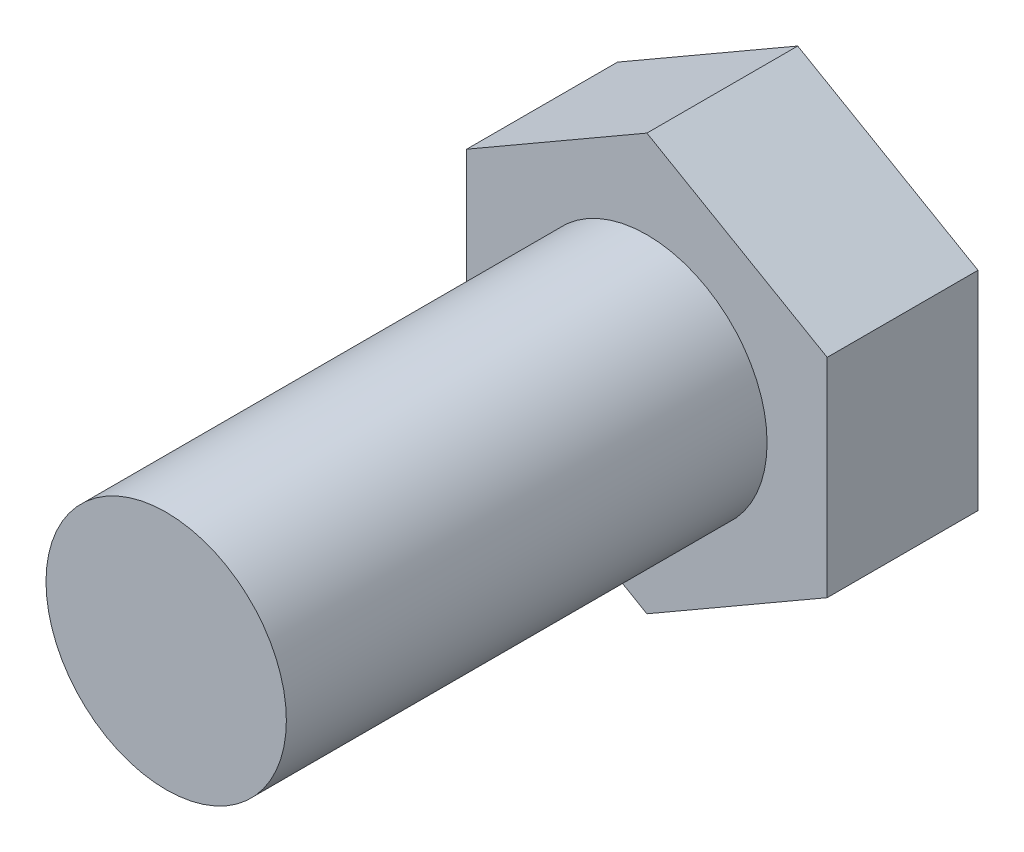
ISO-10303-21;
HEADER;
FILE_DESCRIPTION(('STEP AP214'),'2;1');
FILE_NAME('part.step','',(''),(''),'','','');
FILE_SCHEMA(('AUTOMOTIVE_DESIGN { 1 0 10303 214 1 1 1 1 }'));
ENDSEC;
DATA;
#1=APPLICATION_CONTEXT('core data for automotive mechanical design processes');
#2=APPLICATION_PROTOCOL_DEFINITION('international standard','automotive_design',2000,#1);
#3=PRODUCT_CONTEXT('',#1,'mechanical');
#4=PRODUCT('Part','Part','',(#3));
#5=PRODUCT_RELATED_PRODUCT_CATEGORY('part','',(#4));
#6=PRODUCT_DEFINITION_FORMATION('','',#4);
#7=PRODUCT_DEFINITION_CONTEXT('part definition',#1,'design');
#8=PRODUCT_DEFINITION('design','',#6,#7);
#9=PRODUCT_DEFINITION_SHAPE('','',#8);
#10=(LENGTH_UNIT() NAMED_UNIT(*) SI_UNIT(.MILLI.,.METRE.));
#11=(NAMED_UNIT(*) PLANE_ANGLE_UNIT() SI_UNIT($,.RADIAN.));
#12=(NAMED_UNIT(*) SI_UNIT($,.STERADIAN.) SOLID_ANGLE_UNIT());
#13=UNCERTAINTY_MEASURE_WITH_UNIT(LENGTH_MEASURE(1.E-05),#10,'distance_accuracy_value','');
#14=(GEOMETRIC_REPRESENTATION_CONTEXT(3) GLOBAL_UNCERTAINTY_ASSIGNED_CONTEXT((#13)) GLOBAL_UNIT_ASSIGNED_CONTEXT((#10,
#11,#12)) REPRESENTATION_CONTEXT('',''));
#15=CARTESIAN_POINT('',(0.,0.,0.));
#16=DIRECTION('',(0.,0.,1.));
#17=DIRECTION('',(1.,0.,0.));
#18=AXIS2_PLACEMENT_3D('',#15,#16,#17);
#19=CARTESIAN_POINT('',(0.,0.,53.7));
#20=DIRECTION('',(0.,0.,-1.));
#21=DIRECTION('',(-1.,0.,0.));
#22=AXIS2_PLACEMENT_3D('',#19,#20,#21);
#23=PLANE('',#22);
#24=CARTESIAN_POINT('',(0.,0.,53.7));
#25=DIRECTION('',(0.,0.,-1.));
#26=DIRECTION('',(-1.,0.,0.));
#27=AXIS2_PLACEMENT_3D('',#24,#25,#26);
#28=CIRCLE('',#27,10.);
#29=CARTESIAN_POINT('',(-10.,0.,53.7));
#30=VERTEX_POINT('',#29);
#31=EDGE_CURVE('E22',#30,#30,#28,.T.);
#32=ORIENTED_EDGE('',*,*,#31,.F.);
#33=EDGE_LOOP('',(#32));
#34=FACE_BOUND('',#33,.T.);
#35=ADVANCED_FACE('F15',(#34),#23,.F.);
#36=CARTESIAN_POINT('',(0.,0.,-16.3));
#37=DIRECTION('',(0.,0.,-1.));
#38=DIRECTION('',(-1.,0.,0.));
#39=AXIS2_PLACEMENT_3D('',#36,#37,#38);
#40=CYLINDRICAL_SURFACE('',#39,10.);
#41=CARTESIAN_POINT('',(0.,0.,13.7));
#42=DIRECTION('',(0.,0.,-1.));
#43=DIRECTION('',(-1.,0.,0.));
#44=AXIS2_PLACEMENT_3D('',#41,#42,#43);
#45=CIRCLE('',#44,10.);
#46=CARTESIAN_POINT('',(-10.,0.,13.7));
#47=VERTEX_POINT('',#46);
#48=EDGE_CURVE('E110',#47,#47,#45,.T.);
#49=ORIENTED_EDGE('',*,*,#48,.F.);
#50=EDGE_LOOP('',(#49));
#51=FACE_BOUND('',#50,.T.);
#52=ORIENTED_EDGE('',*,*,#31,.T.);
#53=EDGE_LOOP('',(#52));
#54=FACE_BOUND('',#53,.T.);
#55=ADVANCED_FACE('F154',(#51,#54),#40,.T.);
#56=CARTESIAN_POINT('',(-10.,0.,13.7));
#57=DIRECTION('',(0.,0.,-1.));
#58=DIRECTION('',(-1.,0.,0.));
#59=AXIS2_PLACEMENT_3D('',#56,#57,#58);
#60=PLANE('',#59);
#61=DIRECTION('',(0.866025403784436,-0.5,0.));
#62=VECTOR('',#61,1.);
#63=CARTESIAN_POINT('',(1.12757025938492E-13,17.3205080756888,13.7));
#64=LINE('',#63,#62);
#65=CARTESIAN_POINT('',(0.,17.3205080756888,13.7));
#66=VERTEX_POINT('',#65);
#67=CARTESIAN_POINT('',(15.,8.66025403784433,13.7));
#68=VERTEX_POINT('',#67);
#69=EDGE_CURVE('E81',#66,#68,#64,.T.);
#70=ORIENTED_EDGE('',*,*,#69,.F.);
#71=DIRECTION('',(-0.866025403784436,-0.5,0.));
#72=VECTOR('',#71,1.);
#73=CARTESIAN_POINT('',(-15.,8.66025403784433,13.7));
#74=LINE('',#73,#72);
#75=CARTESIAN_POINT('',(-15.,8.66025403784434,13.7));
#76=VERTEX_POINT('',#75);
#77=EDGE_CURVE('E107',#66,#76,#74,.T.);
#78=ORIENTED_EDGE('',*,*,#77,.T.);
#79=DIRECTION('',(0.,-1.,0.));
#80=VECTOR('',#79,1.);
#81=CARTESIAN_POINT('',(-15.,0.,13.7));
#82=LINE('',#81,#80);
#83=CARTESIAN_POINT('',(-15.,-8.66025403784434,13.7));
#84=VERTEX_POINT('',#83);
#85=EDGE_CURVE('E104',#76,#84,#82,.T.);
#86=ORIENTED_EDGE('',*,*,#85,.T.);
#87=DIRECTION('',(-0.866025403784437,0.5,0.));
#88=VECTOR('',#87,1.);
#89=CARTESIAN_POINT('',(-15.,-8.66025403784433,13.7));
#90=LINE('',#89,#88);
#91=CARTESIAN_POINT('',(0.,-17.3205080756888,13.7));
#92=VERTEX_POINT('',#91);
#93=EDGE_CURVE('E102',#92,#84,#90,.T.);
#94=ORIENTED_EDGE('',*,*,#93,.F.);
#95=DIRECTION('',(0.866025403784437,0.5,0.));
#96=VECTOR('',#95,1.);
#97=CARTESIAN_POINT('',(0.,-17.3205080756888,13.7));
#98=LINE('',#97,#96);
#99=CARTESIAN_POINT('',(15.,-8.66025403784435,13.7));
#100=VERTEX_POINT('',#99);
#101=EDGE_CURVE('E99',#92,#100,#98,.T.);
#102=ORIENTED_EDGE('',*,*,#101,.T.);
#103=DIRECTION('',(0.,-1.,0.));
#104=VECTOR('',#103,1.);
#105=CARTESIAN_POINT('',(15.,0.,13.7));
#106=LINE('',#105,#104);
#107=EDGE_CURVE('E97',#68,#100,#106,.T.);
#108=ORIENTED_EDGE('',*,*,#107,.F.);
#109=EDGE_LOOP('',(#70,#78,#86,#94,#102,#108));
#110=FACE_BOUND('',#109,.T.);
#111=ORIENTED_EDGE('',*,*,#48,.T.);
#112=EDGE_LOOP('',(#111));
#113=FACE_BOUND('',#112,.T.);
#114=ADVANCED_FACE('F136',(#110,#113),#60,.F.);
#115=CARTESIAN_POINT('',(0.,17.3205080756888,15.));
#116=DIRECTION('',(0.5,-0.866025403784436,0.));
#117=DIRECTION('',(-0.866025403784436,-0.5,0.));
#118=AXIS2_PLACEMENT_3D('',#115,#116,#117);
#119=PLANE('',#118);
#120=DIRECTION('',(0.,0.,-1.));
#121=VECTOR('',#120,1.);
#122=CARTESIAN_POINT('',(0.,17.3205080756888,15.));
#123=LINE('',#122,#121);
#124=CARTESIAN_POINT('',(0.,17.3205080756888,1.15));
#125=VERTEX_POINT('',#124);
#126=EDGE_CURVE('E35',#66,#125,#123,.T.);
#127=ORIENTED_EDGE('',*,*,#126,.T.);
#128=DIRECTION('',(-0.866025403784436,-0.5,0.));
#129=VECTOR('',#128,1.);
#130=CARTESIAN_POINT('',(0.,17.3205080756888,1.15));
#131=LINE('',#130,#129);
#132=CARTESIAN_POINT('',(-15.,8.66025403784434,1.15));
#133=VERTEX_POINT('',#132);
#134=EDGE_CURVE('E28',#125,#133,#131,.T.);
#135=ORIENTED_EDGE('',*,*,#134,.T.);
#136=DIRECTION('',(0.,0.,-1.));
#137=VECTOR('',#136,1.);
#138=CARTESIAN_POINT('',(-15.,8.66025403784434,15.));
#139=LINE('',#138,#137);
#140=EDGE_CURVE('E93',#76,#133,#139,.T.);
#141=ORIENTED_EDGE('',*,*,#140,.F.);
#142=ORIENTED_EDGE('',*,*,#77,.F.);
#143=EDGE_LOOP('',(#127,#135,#141,#142));
#144=FACE_BOUND('',#143,.T.);
#145=ADVANCED_FACE('F130',(#144),#119,.F.);
#146=CARTESIAN_POINT('',(-15.,8.66025403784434,15.));
#147=DIRECTION('',(1.,0.,0.));
#148=DIRECTION('',(0.,-1.,0.));
#149=AXIS2_PLACEMENT_3D('',#146,#147,#148);
#150=PLANE('',#149);
#151=ORIENTED_EDGE('',*,*,#140,.T.);
#152=DIRECTION('',(0.,-1.,0.));
#153=VECTOR('',#152,1.);
#154=CARTESIAN_POINT('',(-15.,8.66025403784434,1.15));
#155=LINE('',#154,#153);
#156=CARTESIAN_POINT('',(-15.,-8.66025403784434,1.15));
#157=VERTEX_POINT('',#156);
#158=EDGE_CURVE('E126',#133,#157,#155,.T.);
#159=ORIENTED_EDGE('',*,*,#158,.T.);
#160=DIRECTION('',(0.,0.,-1.));
#161=VECTOR('',#160,1.);
#162=CARTESIAN_POINT('',(-15.,-8.66025403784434,15.));
#163=LINE('',#162,#161);
#164=EDGE_CURVE('E90',#84,#157,#163,.T.);
#165=ORIENTED_EDGE('',*,*,#164,.F.);
#166=ORIENTED_EDGE('',*,*,#85,.F.);
#167=EDGE_LOOP('',(#151,#159,#165,#166));
#168=FACE_BOUND('',#167,.T.);
#169=ADVANCED_FACE('F132',(#168),#150,.F.);
#170=CARTESIAN_POINT('',(0.,-17.3205080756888,15.));
#171=DIRECTION('',(-0.5,-0.866025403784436,0.));
#172=DIRECTION('',(-0.866025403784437,0.5,0.));
#173=AXIS2_PLACEMENT_3D('',#170,#171,#172);
#174=PLANE('',#173);
#175=DIRECTION('',(-0.866025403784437,0.5,0.));
#176=VECTOR('',#175,1.);
#177=CARTESIAN_POINT('',(0.,-17.3205080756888,1.15));
#178=LINE('',#177,#176);
#179=CARTESIAN_POINT('',(0.,-17.3205080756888,1.15));
#180=VERTEX_POINT('',#179);
#181=EDGE_CURVE('E124',#180,#157,#178,.T.);
#182=ORIENTED_EDGE('',*,*,#181,.F.);
#183=DIRECTION('',(0.,0.,-1.));
#184=VECTOR('',#183,1.);
#185=CARTESIAN_POINT('',(0.,-17.3205080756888,15.));
#186=LINE('',#185,#184);
#187=EDGE_CURVE('E83',#92,#180,#186,.T.);
#188=ORIENTED_EDGE('',*,*,#187,.F.);
#189=ORIENTED_EDGE('',*,*,#93,.T.);
#190=ORIENTED_EDGE('',*,*,#164,.T.);
#191=EDGE_LOOP('',(#182,#188,#189,#190));
#192=FACE_BOUND('',#191,.T.);
#193=ADVANCED_FACE('F143',(#192),#174,.T.);
#194=CARTESIAN_POINT('',(0.,-17.3205080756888,15.));
#195=DIRECTION('',(-0.5,0.866025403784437,0.));
#196=DIRECTION('',(0.866025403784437,0.5,0.));
#197=AXIS2_PLACEMENT_3D('',#194,#195,#196);
#198=PLANE('',#197);
#199=ORIENTED_EDGE('',*,*,#187,.T.);
#200=DIRECTION('',(0.866025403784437,0.5,0.));
#201=VECTOR('',#200,1.);
#202=CARTESIAN_POINT('',(0.,-17.3205080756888,1.15));
#203=LINE('',#202,#201);
#204=CARTESIAN_POINT('',(15.,-8.66025403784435,1.15));
#205=VERTEX_POINT('',#204);
#206=EDGE_CURVE('E76',#180,#205,#203,.T.);
#207=ORIENTED_EDGE('',*,*,#206,.T.);
#208=DIRECTION('',(0.,0.,-1.));
#209=VECTOR('',#208,1.);
#210=CARTESIAN_POINT('',(15.,-8.66025403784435,15.));
#211=LINE('',#210,#209);
#212=EDGE_CURVE('E75',#100,#205,#211,.T.);
#213=ORIENTED_EDGE('',*,*,#212,.F.);
#214=ORIENTED_EDGE('',*,*,#101,.F.);
#215=EDGE_LOOP('',(#199,#207,#213,#214));
#216=FACE_BOUND('',#215,.T.);
#217=ADVANCED_FACE('F139',(#216),#198,.F.);
#218=CARTESIAN_POINT('',(15.,8.66025403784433,15.));
#219=DIRECTION('',(1.,0.,0.));
#220=DIRECTION('',(0.,-1.,0.));
#221=AXIS2_PLACEMENT_3D('',#218,#219,#220);
#222=PLANE('',#221);
#223=DIRECTION('',(0.,-1.,0.));
#224=VECTOR('',#223,1.);
#225=CARTESIAN_POINT('',(15.,8.66025403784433,1.15));
#226=LINE('',#225,#224);
#227=CARTESIAN_POINT('',(15.,8.66025403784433,1.15));
#228=VERTEX_POINT('',#227);
#229=EDGE_CURVE('E65',#228,#205,#226,.T.);
#230=ORIENTED_EDGE('',*,*,#229,.F.);
#231=DIRECTION('',(0.,0.,-1.));
#232=VECTOR('',#231,1.);
#233=CARTESIAN_POINT('',(15.,8.66025403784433,15.));
#234=LINE('',#233,#232);
#235=EDGE_CURVE('E72',#68,#228,#234,.T.);
#236=ORIENTED_EDGE('',*,*,#235,.F.);
#237=ORIENTED_EDGE('',*,*,#107,.T.);
#238=ORIENTED_EDGE('',*,*,#212,.T.);
#239=EDGE_LOOP('',(#230,#236,#237,#238));
#240=FACE_BOUND('',#239,.T.);
#241=ADVANCED_FACE('F71',(#240),#222,.T.);
#242=CARTESIAN_POINT('',(0.,17.3205080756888,15.));
#243=DIRECTION('',(0.5,0.866025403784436,0.));
#244=DIRECTION('',(0.866025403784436,-0.5,0.));
#245=AXIS2_PLACEMENT_3D('',#242,#243,#244);
#246=PLANE('',#245);
#247=DIRECTION('',(0.866025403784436,-0.5,0.));
#248=VECTOR('',#247,1.);
#249=CARTESIAN_POINT('',(0.,17.3205080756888,1.15));
#250=LINE('',#249,#248);
#251=EDGE_CURVE('E9',#125,#228,#250,.T.);
#252=ORIENTED_EDGE('',*,*,#251,.F.);
#253=ORIENTED_EDGE('',*,*,#126,.F.);
#254=ORIENTED_EDGE('',*,*,#69,.T.);
#255=ORIENTED_EDGE('',*,*,#235,.T.);
#256=EDGE_LOOP('',(#252,#253,#254,#255));
#257=FACE_BOUND('',#256,.T.);
#258=ADVANCED_FACE('F79',(#257),#246,.T.);
#259=CARTESIAN_POINT('',(0.,19.25,1.15));
#260=DIRECTION('',(0.,0.,1.));
#261=DIRECTION('',(1.,0.,0.));
#262=AXIS2_PLACEMENT_3D('',#259,#260,#261);
#263=PLANE('',#262);
#264=CARTESIAN_POINT('',(0.,0.,1.15));
#265=DIRECTION('',(0.,0.,-1.));
#266=DIRECTION('',(-1.,0.,0.));
#267=AXIS2_PLACEMENT_3D('',#264,#265,#266);
#268=CIRCLE('',#267,12.7);
#269=CARTESIAN_POINT('',(-12.7,0.,1.15));
#270=VERTEX_POINT('',#269);
#271=EDGE_CURVE('E115',#270,#270,#268,.T.);
#272=ORIENTED_EDGE('',*,*,#271,.F.);
#273=EDGE_LOOP('',(#272));
#274=FACE_BOUND('',#273,.T.);
#275=ORIENTED_EDGE('',*,*,#251,.T.);
#276=ORIENTED_EDGE('',*,*,#229,.T.);
#277=ORIENTED_EDGE('',*,*,#206,.F.);
#278=ORIENTED_EDGE('',*,*,#181,.T.);
#279=ORIENTED_EDGE('',*,*,#158,.F.);
#280=ORIENTED_EDGE('',*,*,#134,.F.);
#281=EDGE_LOOP('',(#275,#276,#277,#278,#279,#280));
#282=FACE_BOUND('',#281,.T.);
#283=ADVANCED_FACE('F64',(#274,#282),#263,.F.);
#284=CARTESIAN_POINT('',(0.,0.,13.7));
#285=DIRECTION('',(0.,0.,-1.));
#286=DIRECTION('',(-1.,0.,0.));
#287=AXIS2_PLACEMENT_3D('',#284,#285,#286);
#288=CYLINDRICAL_SURFACE('',#287,12.7);
#289=ORIENTED_EDGE('',*,*,#271,.T.);
#290=EDGE_LOOP('',(#289));
#291=FACE_BOUND('',#290,.T.);
#292=CARTESIAN_POINT('',(0.,0.,0.));
#293=DIRECTION('',(0.,0.,1.));
#294=DIRECTION('',(1.,0.,0.));
#295=AXIS2_PLACEMENT_3D('',#292,#293,#294);
#296=CIRCLE('',#295,12.7);
#297=CARTESIAN_POINT('',(12.7,0.,0.));
#298=VERTEX_POINT('',#297);
#299=EDGE_CURVE('E77',#298,#298,#296,.T.);
#300=ORIENTED_EDGE('',*,*,#299,.T.);
#301=EDGE_LOOP('',(#300));
#302=FACE_BOUND('',#301,.T.);
#303=ADVANCED_FACE('F170',(#291,#302),#288,.T.);
#304=CARTESIAN_POINT('',(-17.5,0.,0.));
#305=DIRECTION('',(0.,0.,1.));
#306=DIRECTION('',(1.,0.,0.));
#307=AXIS2_PLACEMENT_3D('',#304,#305,#306);
#308=PLANE('',#307);
#309=ORIENTED_EDGE('',*,*,#299,.F.);
#310=EDGE_LOOP('',(#309));
#311=FACE_BOUND('',#310,.T.);
#312=ADVANCED_FACE('F168',(#311),#308,.F.);
#313=CLOSED_SHELL('',(#35,#55,#114,#145,#169,#193,#217,#241,#258,#283,#303,#312));
#314=MANIFOLD_SOLID_BREP('B1',#313);
#315=ADVANCED_BREP_SHAPE_REPRESENTATION('',(#18,#314),#14);
#316=SHAPE_DEFINITION_REPRESENTATION(#9,#315);
ENDSEC;
END-ISO-10303-21;
